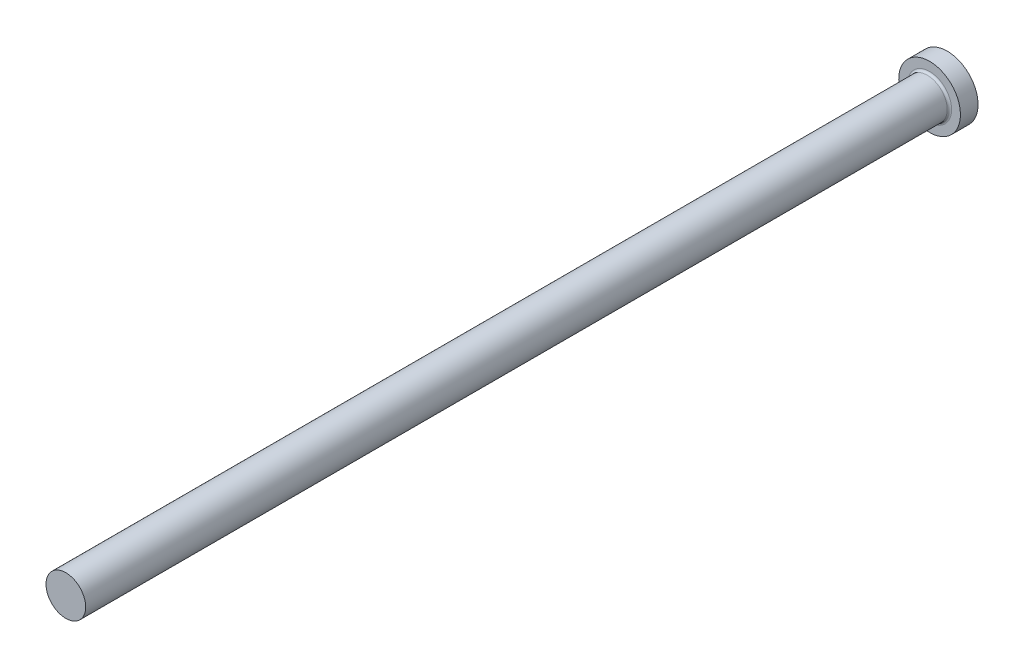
from build123d import *

# Parameters (mm, degrees)
FILLET1_R = 0.5


with BuildPart() as part:
    # FV → Revolve1 (revolve)
    with BuildSketch(Plane(origin=(0, 0, 0), x_dir=(1, 0, 0), z_dir=(0, 1, 0)), mode=Mode.PRIVATE) as revolve1_sk:
        Polygon((0, 0), (7, 0), (7, -4), (4.5, -4), (4.5, -200), (0, -200), align=None)
    revolve(revolve1_sk.sketch.rotate(Axis((0, 0, -9.033228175), (0, 0, 1)), 180), axis=Axis((0, 0, -9.033228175), (0, 0, 1)))

    # Fillet1
    fillet1_edges = [part.edges().sort_by_distance(p)[0] for p in [
        (4.5, 0, 4),
    ]]
    fillet(fillet1_edges, radius=FILLET1_R)


solid = part.part
